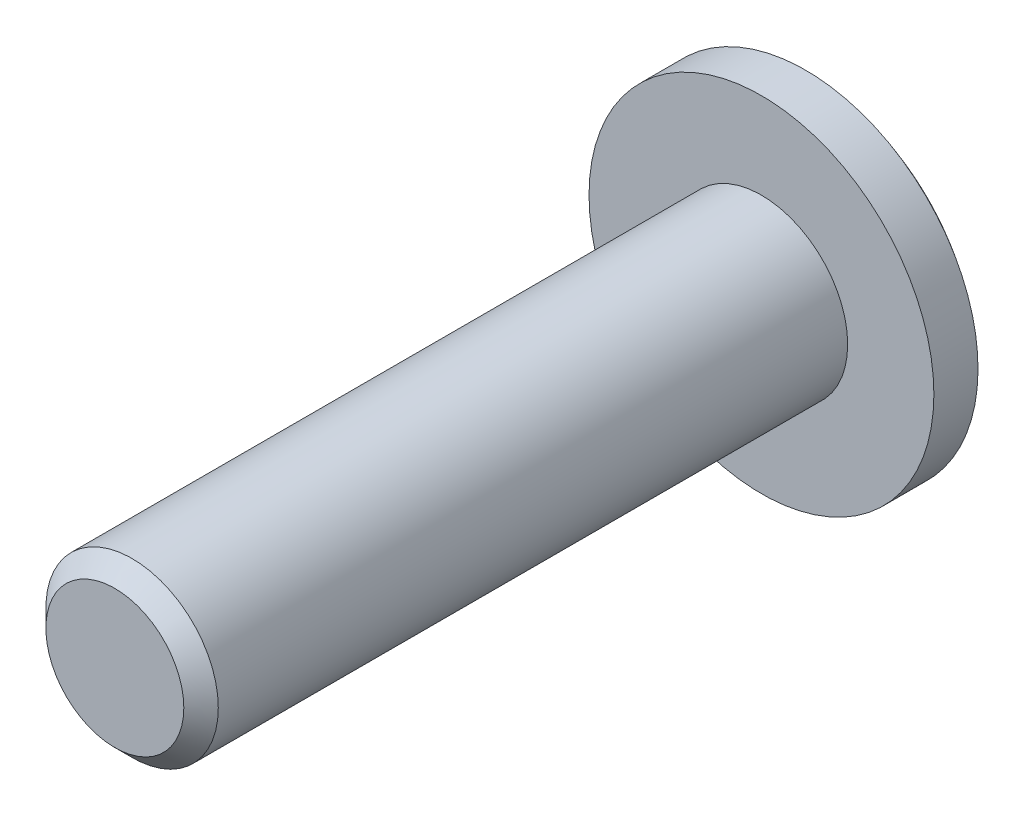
from build123d import *

# Parameters (mm, degrees)
ENL_V_MAT_EXTRU_5_DEPTH = 10
ESQUISSE3_W             = 4
ESQUISSE3_H             = 30
CHANFREIN1_SIZE         = 0.8


with BuildPart() as part:
    # Esquisse1 → Base-R_volution (revolve)
    with BuildSketch(Plane(origin=(0, 0, 0), x_dir=(1, 0, 0), z_dir=(0, 1, 0))):
        with BuildLine():
            Line((0, 0), (8, 0))
            Line((8, 0), (8, 2.046950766))
            ThreePointArc((8, 2.046950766), (4.230226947, 4.092484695), (0, 4.8))
            Line((0, 4.8), (0, 0))
        make_face()
    revolve(axis=Axis((0, 0, 0), (0, 0, -1)))

    # Esquisse6 → Enl_v. mat.-Extru.5 (cut)
    with BuildSketch(Plane.XY.offset(-12)):
        Polygon((0, 4.041451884), (-3.5, 2.020725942), (-3.5, -2.020725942), (0, -4.041451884), (3.5, -2.020725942), (3.5, 2.020725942), align=None)
    extrude(amount=ENL_V_MAT_EXTRU_5_DEPTH, mode=Mode.SUBTRACT)

    # Esquisse3 → Boss.-R_vol.1 (revolve)
    with BuildSketch(Plane(origin=(0, 0, 0), x_dir=(1, 0, 0), z_dir=(0, 1, 0)), mode=Mode.PRIVATE) as boss_r_vol_1_sk:
        with Locations((2, -15)):
            Rectangle(ESQUISSE3_W, ESQUISSE3_H)
    revolve(boss_r_vol_1_sk.sketch.rotate(Axis((0, 0, 0), (0, 0, 1)), 30), axis=Axis((0, 0, 0), (0, 0, 1)))

    # Chanfrein1
    chanfrein1_edges = [part.edges().sort_by_distance(p)[0] for p in [
        (-3.464101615, -2, 30),
    ]]
    chamfer(chanfrein1_edges, length=CHANFREIN1_SIZE)


solid = part.part
